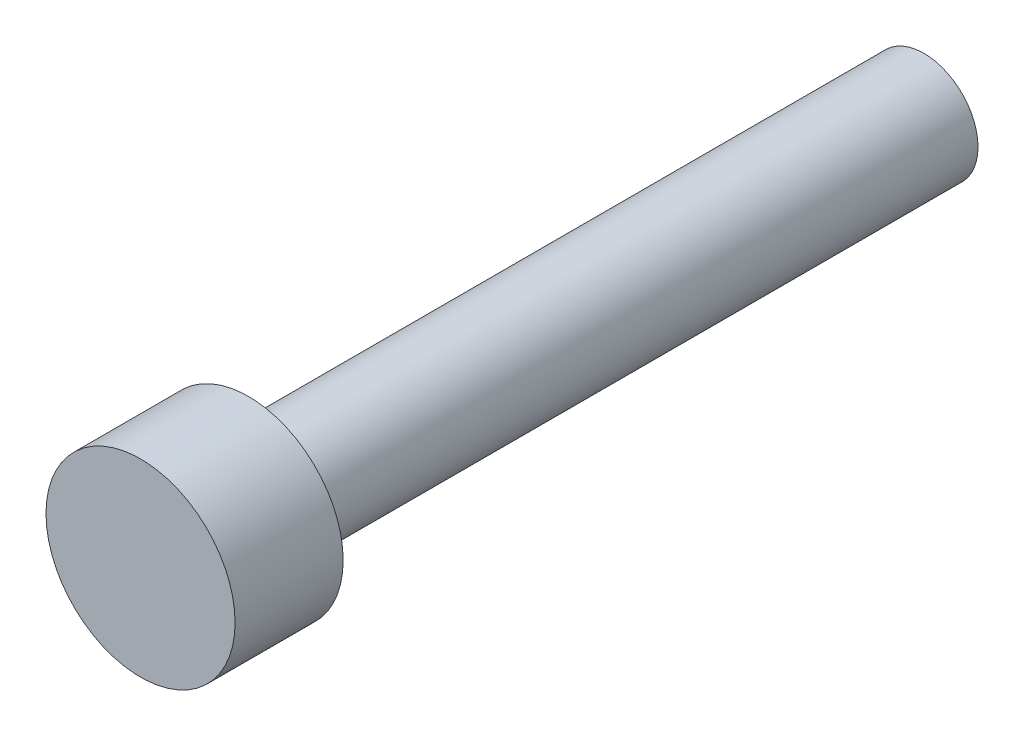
from build123d import *

# Parameters (mm, degrees)
SKETCH_1_R      = 2
EXTRUDE_1_DEPTH = 25
SKETCH_2_R      = 3.5
EXTRUDE_2_DEPTH = 4


with BuildPart() as part:
    # Sketch 1 → Extrude 1 (new body)
    with BuildSketch(Plane.XY):
        Circle(SKETCH_1_R)
    extrude(amount=EXTRUDE_1_DEPTH)

    # Sketch 2 → Extrude 2 (add)
    with BuildSketch(Plane.XY.offset(25)):
        Circle(SKETCH_2_R)
    extrude(amount=EXTRUDE_2_DEPTH)


solid = part.part
